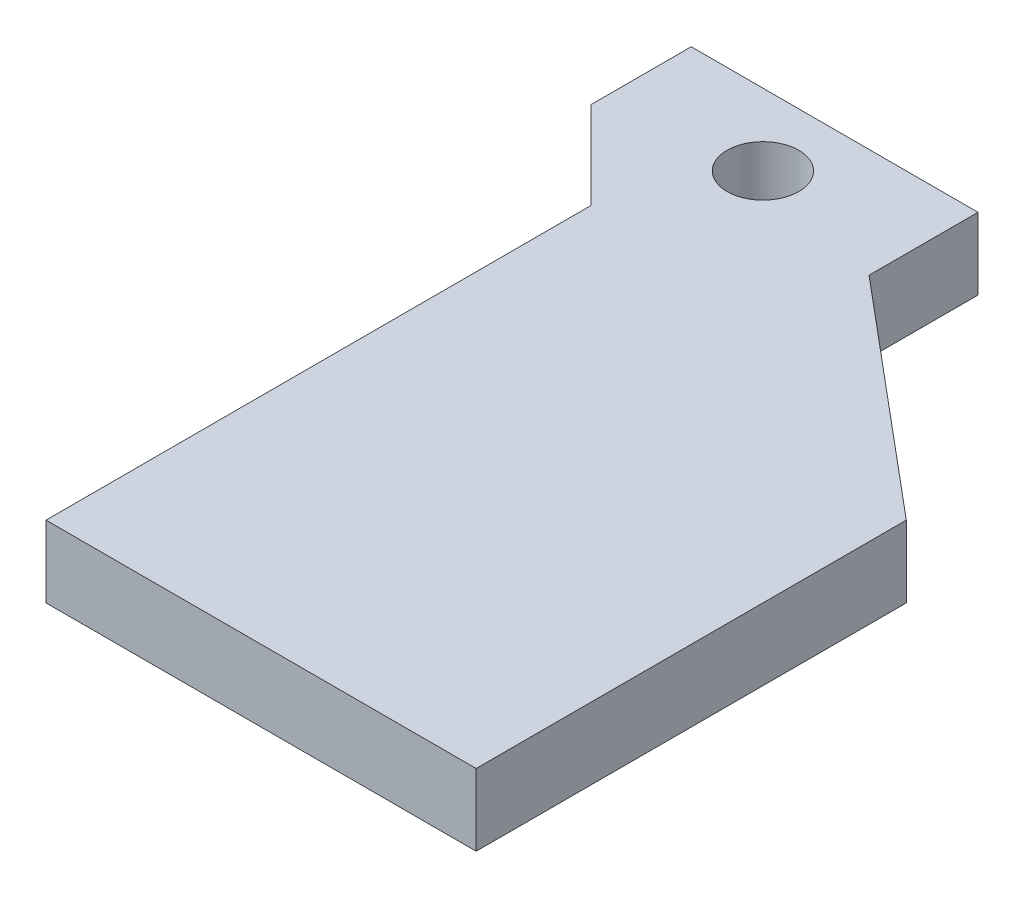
ISO-10303-21;
HEADER;
FILE_DESCRIPTION(('STEP AP214'),'2;1');
FILE_NAME('part.step','',(''),(''),'','','');
FILE_SCHEMA(('AUTOMOTIVE_DESIGN { 1 0 10303 214 1 1 1 1 }'));
ENDSEC;
DATA;
#1=APPLICATION_CONTEXT('core data for automotive mechanical design processes');
#2=APPLICATION_PROTOCOL_DEFINITION('international standard','automotive_design',2000,#1);
#3=PRODUCT_CONTEXT('',#1,'mechanical');
#4=PRODUCT('Part','Part','',(#3));
#5=PRODUCT_RELATED_PRODUCT_CATEGORY('part','',(#4));
#6=PRODUCT_DEFINITION_FORMATION('','',#4);
#7=PRODUCT_DEFINITION_CONTEXT('part definition',#1,'design');
#8=PRODUCT_DEFINITION('design','',#6,#7);
#9=PRODUCT_DEFINITION_SHAPE('','',#8);
#10=(LENGTH_UNIT() NAMED_UNIT(*) SI_UNIT(.MILLI.,.METRE.));
#11=(NAMED_UNIT(*) PLANE_ANGLE_UNIT() SI_UNIT($,.RADIAN.));
#12=(NAMED_UNIT(*) SI_UNIT($,.STERADIAN.) SOLID_ANGLE_UNIT());
#13=UNCERTAINTY_MEASURE_WITH_UNIT(LENGTH_MEASURE(1.E-05),#10,'distance_accuracy_value','');
#14=(GEOMETRIC_REPRESENTATION_CONTEXT(3) GLOBAL_UNCERTAINTY_ASSIGNED_CONTEXT((#13)) GLOBAL_UNIT_ASSIGNED_CONTEXT((#10,
#11,#12)) REPRESENTATION_CONTEXT('',''));
#15=CARTESIAN_POINT('',(0.,0.,0.));
#16=DIRECTION('',(0.,0.,1.));
#17=DIRECTION('',(1.,0.,0.));
#18=AXIS2_PLACEMENT_3D('',#15,#16,#17);
#19=CARTESIAN_POINT('',(-5.35521441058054,5.,5.87849918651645));
#20=DIRECTION('',(1.,0.,0.));
#21=DIRECTION('',(0.,0.,-1.));
#22=AXIS2_PLACEMENT_3D('',#19,#20,#21);
#23=PLANE('',#22);
#24=DIRECTION('',(0.,0.,1.));
#25=VECTOR('',#24,1.);
#26=CARTESIAN_POINT('',(-5.35521441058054,0.,5.87849918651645));
#27=LINE('',#26,#25);
#28=CARTESIAN_POINT('',(-5.35521441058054,0.,-32.1215008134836));
#29=VERTEX_POINT('',#28);
#30=CARTESIAN_POINT('',(-5.35521441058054,0.,5.87849918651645));
#31=VERTEX_POINT('',#30);
#32=EDGE_CURVE('E94',#29,#31,#27,.T.);
#33=ORIENTED_EDGE('',*,*,#32,.T.);
#34=DIRECTION('',(0.,-1.,0.));
#35=VECTOR('',#34,1.);
#36=CARTESIAN_POINT('',(-5.35521441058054,5.,5.87849918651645));
#37=LINE('',#36,#35);
#38=CARTESIAN_POINT('',(-5.35521441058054,5.,5.87849918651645));
#39=VERTEX_POINT('',#38);
#40=EDGE_CURVE('E11',#39,#31,#37,.T.);
#41=ORIENTED_EDGE('',*,*,#40,.F.);
#42=DIRECTION('',(0.,0.,1.));
#43=VECTOR('',#42,1.);
#44=CARTESIAN_POINT('',(-5.35521441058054,5.,5.87849918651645));
#45=LINE('',#44,#43);
#46=CARTESIAN_POINT('',(-5.35521441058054,5.,-32.1215008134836));
#47=VERTEX_POINT('',#46);
#48=EDGE_CURVE('E126',#47,#39,#45,.T.);
#49=ORIENTED_EDGE('',*,*,#48,.F.);
#50=DIRECTION('',(0.,-1.,0.));
#51=VECTOR('',#50,1.);
#52=CARTESIAN_POINT('',(-5.35521441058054,5.,-32.1215008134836));
#53=LINE('',#52,#51);
#54=EDGE_CURVE('E107',#47,#29,#53,.T.);
#55=ORIENTED_EDGE('',*,*,#54,.T.);
#56=EDGE_LOOP('',(#33,#41,#49,#55));
#57=FACE_BOUND('',#56,.T.);
#58=ADVANCED_FACE('F26',(#57),#23,.F.);
#59=CARTESIAN_POINT('',(-5.35521441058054,5.,5.87849918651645));
#60=DIRECTION('',(0.,0.,-1.));
#61=DIRECTION('',(-1.,0.,0.));
#62=AXIS2_PLACEMENT_3D('',#59,#60,#61);
#63=PLANE('',#62);
#64=DIRECTION('',(1.,0.,0.));
#65=VECTOR('',#64,1.);
#66=CARTESIAN_POINT('',(-5.35521441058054,0.,5.87849918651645));
#67=LINE('',#66,#65);
#68=CARTESIAN_POINT('',(24.6447855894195,0.,5.87849918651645));
#69=VERTEX_POINT('',#68);
#70=EDGE_CURVE('E90',#31,#69,#67,.T.);
#71=ORIENTED_EDGE('',*,*,#70,.T.);
#72=DIRECTION('',(0.,-1.,0.));
#73=VECTOR('',#72,1.);
#74=CARTESIAN_POINT('',(24.6447855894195,5.,5.87849918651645));
#75=LINE('',#74,#73);
#76=CARTESIAN_POINT('',(24.6447855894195,5.,5.87849918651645));
#77=VERTEX_POINT('',#76);
#78=EDGE_CURVE('E33',#77,#69,#75,.T.);
#79=ORIENTED_EDGE('',*,*,#78,.F.);
#80=DIRECTION('',(1.,0.,0.));
#81=VECTOR('',#80,1.);
#82=CARTESIAN_POINT('',(-5.35521441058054,5.,5.87849918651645));
#83=LINE('',#82,#81);
#84=EDGE_CURVE('E103',#39,#77,#83,.T.);
#85=ORIENTED_EDGE('',*,*,#84,.F.);
#86=ORIENTED_EDGE('',*,*,#40,.T.);
#87=EDGE_LOOP('',(#71,#79,#85,#86));
#88=FACE_BOUND('',#87,.T.);
#89=ADVANCED_FACE('F102',(#88),#63,.F.);
#90=CARTESIAN_POINT('',(24.6447855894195,5.,5.87849918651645));
#91=DIRECTION('',(-1.,0.,0.));
#92=DIRECTION('',(0.,0.,1.));
#93=AXIS2_PLACEMENT_3D('',#90,#91,#92);
#94=PLANE('',#93);
#95=DIRECTION('',(0.,0.,-1.));
#96=VECTOR('',#95,1.);
#97=CARTESIAN_POINT('',(24.6447855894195,0.,5.87849918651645));
#98=LINE('',#97,#96);
#99=CARTESIAN_POINT('',(24.6447855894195,0.,-24.1215008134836));
#100=VERTEX_POINT('',#99);
#101=EDGE_CURVE('E96',#69,#100,#98,.T.);
#102=ORIENTED_EDGE('',*,*,#101,.T.);
#103=DIRECTION('',(0.,-1.,0.));
#104=VECTOR('',#103,1.);
#105=CARTESIAN_POINT('',(24.6447855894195,5.,-24.1215008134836));
#106=LINE('',#105,#104);
#107=CARTESIAN_POINT('',(24.6447855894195,5.,-24.1215008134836));
#108=VERTEX_POINT('',#107);
#109=EDGE_CURVE('E152',#108,#100,#106,.T.);
#110=ORIENTED_EDGE('',*,*,#109,.F.);
#111=DIRECTION('',(0.,0.,-1.));
#112=VECTOR('',#111,1.);
#113=CARTESIAN_POINT('',(24.6447855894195,5.,5.87849918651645));
#114=LINE('',#113,#112);
#115=EDGE_CURVE('E129',#77,#108,#114,.T.);
#116=ORIENTED_EDGE('',*,*,#115,.F.);
#117=ORIENTED_EDGE('',*,*,#78,.T.);
#118=EDGE_LOOP('',(#102,#110,#116,#117));
#119=FACE_BOUND('',#118,.T.);
#120=ADVANCED_FACE('F156',(#119),#94,.F.);
#121=CARTESIAN_POINT('',(24.6447855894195,5.,-24.1215008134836));
#122=DIRECTION('',(-0.642487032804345,0.,0.766296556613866));
#123=DIRECTION('',(0.766296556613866,0.,0.642487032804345));
#124=AXIS2_PLACEMENT_3D('',#121,#122,#123);
#125=PLANE('',#124);
#126=DIRECTION('',(-0.766296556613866,0.,-0.642487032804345));
#127=VECTOR('',#126,1.);
#128=CARTESIAN_POINT('',(24.6447855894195,0.,-24.1215008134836));
#129=LINE('',#128,#127);
#130=CARTESIAN_POINT('',(8.55255790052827,0.,-37.6137285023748));
#131=VERTEX_POINT('',#130);
#132=EDGE_CURVE('E116',#100,#131,#129,.T.);
#133=ORIENTED_EDGE('',*,*,#132,.T.);
#134=DIRECTION('',(0.,-1.,0.));
#135=VECTOR('',#134,1.);
#136=CARTESIAN_POINT('',(8.55255790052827,5.,-37.6137285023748));
#137=LINE('',#136,#135);
#138=CARTESIAN_POINT('',(8.55255790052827,5.,-37.6137285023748));
#139=VERTEX_POINT('',#138);
#140=EDGE_CURVE('E149',#139,#131,#137,.T.);
#141=ORIENTED_EDGE('',*,*,#140,.F.);
#142=DIRECTION('',(-0.766296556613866,0.,-0.642487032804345));
#143=VECTOR('',#142,1.);
#144=CARTESIAN_POINT('',(24.6447855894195,5.,-24.1215008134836));
#145=LINE('',#144,#143);
#146=EDGE_CURVE('E131',#108,#139,#145,.T.);
#147=ORIENTED_EDGE('',*,*,#146,.F.);
#148=ORIENTED_EDGE('',*,*,#109,.T.);
#149=EDGE_LOOP('',(#133,#141,#147,#148));
#150=FACE_BOUND('',#149,.T.);
#151=ADVANCED_FACE('F164',(#150),#125,.F.);
#152=CARTESIAN_POINT('',(8.55255790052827,5.,-37.6137285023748));
#153=DIRECTION('',(-1.,0.,0.));
#154=DIRECTION('',(0.,0.,1.));
#155=AXIS2_PLACEMENT_3D('',#152,#153,#154);
#156=PLANE('',#155);
#157=DIRECTION('',(0.,0.,-1.));
#158=VECTOR('',#157,1.);
#159=CARTESIAN_POINT('',(8.55255790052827,0.,-37.6137285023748));
#160=LINE('',#159,#158);
#161=CARTESIAN_POINT('',(8.55255790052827,0.,-45.2137285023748));
#162=VERTEX_POINT('',#161);
#163=EDGE_CURVE('E118',#131,#162,#160,.T.);
#164=ORIENTED_EDGE('',*,*,#163,.T.);
#165=DIRECTION('',(0.,-1.,0.));
#166=VECTOR('',#165,1.);
#167=CARTESIAN_POINT('',(8.55255790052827,5.,-45.2137285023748));
#168=LINE('',#167,#166);
#169=CARTESIAN_POINT('',(8.55255790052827,5.,-45.2137285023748));
#170=VERTEX_POINT('',#169);
#171=EDGE_CURVE('E146',#170,#162,#168,.T.);
#172=ORIENTED_EDGE('',*,*,#171,.F.);
#173=DIRECTION('',(0.,0.,-1.));
#174=VECTOR('',#173,1.);
#175=CARTESIAN_POINT('',(8.55255790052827,5.,-37.6137285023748));
#176=LINE('',#175,#174);
#177=EDGE_CURVE('E133',#139,#170,#176,.T.);
#178=ORIENTED_EDGE('',*,*,#177,.F.);
#179=ORIENTED_EDGE('',*,*,#140,.T.);
#180=EDGE_LOOP('',(#164,#172,#178,#179));
#181=FACE_BOUND('',#180,.T.);
#182=ADVANCED_FACE('F167',(#181),#156,.F.);
#183=CARTESIAN_POINT('',(8.55255790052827,5.,-45.2137285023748));
#184=DIRECTION('',(0.,0.,1.));
#185=DIRECTION('',(1.,0.,0.));
#186=AXIS2_PLACEMENT_3D('',#183,#184,#185);
#187=PLANE('',#186);
#188=DIRECTION('',(-1.,0.,0.));
#189=VECTOR('',#188,1.);
#190=CARTESIAN_POINT('',(8.55255790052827,0.,-45.2137285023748));
#191=LINE('',#190,#189);
#192=CARTESIAN_POINT('',(-11.4474420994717,0.,-45.2137285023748));
#193=VERTEX_POINT('',#192);
#194=EDGE_CURVE('E120',#162,#193,#191,.T.);
#195=ORIENTED_EDGE('',*,*,#194,.T.);
#196=DIRECTION('',(0.,-1.,0.));
#197=VECTOR('',#196,1.);
#198=CARTESIAN_POINT('',(-11.4474420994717,5.,-45.2137285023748));
#199=LINE('',#198,#197);
#200=CARTESIAN_POINT('',(-11.4474420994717,5.,-45.2137285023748));
#201=VERTEX_POINT('',#200);
#202=EDGE_CURVE('E143',#201,#193,#199,.T.);
#203=ORIENTED_EDGE('',*,*,#202,.F.);
#204=DIRECTION('',(-1.,0.,0.));
#205=VECTOR('',#204,1.);
#206=CARTESIAN_POINT('',(8.55255790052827,5.,-45.2137285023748));
#207=LINE('',#206,#205);
#208=EDGE_CURVE('E135',#170,#201,#207,.T.);
#209=ORIENTED_EDGE('',*,*,#208,.F.);
#210=ORIENTED_EDGE('',*,*,#171,.T.);
#211=EDGE_LOOP('',(#195,#203,#209,#210));
#212=FACE_BOUND('',#211,.T.);
#213=ADVANCED_FACE('F172',(#212),#187,.F.);
#214=CARTESIAN_POINT('',(-11.4474420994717,5.,-45.2137285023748));
#215=DIRECTION('',(1.,0.,0.));
#216=DIRECTION('',(0.,0.,-1.));
#217=AXIS2_PLACEMENT_3D('',#214,#215,#216);
#218=PLANE('',#217);
#219=DIRECTION('',(0.,0.,1.));
#220=VECTOR('',#219,1.);
#221=CARTESIAN_POINT('',(-11.4474420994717,0.,-45.2137285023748));
#222=LINE('',#221,#220);
#223=CARTESIAN_POINT('',(-11.4474420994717,0.,-38.2137285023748));
#224=VERTEX_POINT('',#223);
#225=EDGE_CURVE('E122',#193,#224,#222,.T.);
#226=ORIENTED_EDGE('',*,*,#225,.T.);
#227=DIRECTION('',(0.,-1.,0.));
#228=VECTOR('',#227,1.);
#229=CARTESIAN_POINT('',(-11.4474420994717,5.,-38.2137285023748));
#230=LINE('',#229,#228);
#231=CARTESIAN_POINT('',(-11.4474420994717,5.,-38.2137285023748));
#232=VERTEX_POINT('',#231);
#233=EDGE_CURVE('E140',#232,#224,#230,.T.);
#234=ORIENTED_EDGE('',*,*,#233,.F.);
#235=DIRECTION('',(0.,0.,1.));
#236=VECTOR('',#235,1.);
#237=CARTESIAN_POINT('',(-11.4474420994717,5.,-45.2137285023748));
#238=LINE('',#237,#236);
#239=EDGE_CURVE('E45',#201,#232,#238,.T.);
#240=ORIENTED_EDGE('',*,*,#239,.F.);
#241=ORIENTED_EDGE('',*,*,#202,.T.);
#242=EDGE_LOOP('',(#226,#234,#240,#241));
#243=FACE_BOUND('',#242,.T.);
#244=ADVANCED_FACE('F175',(#243),#218,.F.);
#245=CARTESIAN_POINT('',(-11.4474420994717,5.,-38.2137285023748));
#246=DIRECTION('',(0.707106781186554,0.,-0.707106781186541));
#247=DIRECTION('',(-0.707106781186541,0.,-0.707106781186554));
#248=AXIS2_PLACEMENT_3D('',#245,#246,#247);
#249=PLANE('',#248);
#250=DIRECTION('',(0.707106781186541,0.,0.707106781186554));
#251=VECTOR('',#250,1.);
#252=CARTESIAN_POINT('',(-11.4474420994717,0.,-38.2137285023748));
#253=LINE('',#252,#251);
#254=EDGE_CURVE('E124',#224,#29,#253,.T.);
#255=ORIENTED_EDGE('',*,*,#254,.T.);
#256=ORIENTED_EDGE('',*,*,#54,.F.);
#257=DIRECTION('',(0.707106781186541,0.,0.707106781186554));
#258=VECTOR('',#257,1.);
#259=CARTESIAN_POINT('',(-11.4474420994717,5.,-38.2137285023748));
#260=LINE('',#259,#258);
#261=EDGE_CURVE('E40',#232,#47,#260,.T.);
#262=ORIENTED_EDGE('',*,*,#261,.F.);
#263=ORIENTED_EDGE('',*,*,#233,.T.);
#264=EDGE_LOOP('',(#255,#256,#262,#263));
#265=FACE_BOUND('',#264,.T.);
#266=ADVANCED_FACE('F177',(#265),#249,.F.);
#267=CARTESIAN_POINT('',(-5.35521441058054,5.,5.87849918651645));
#268=DIRECTION('',(0.,-1.,0.));
#269=DIRECTION('',(0.,0.,-1.));
#270=AXIS2_PLACEMENT_3D('',#267,#268,#269);
#271=PLANE('',#270);
#272=CARTESIAN_POINT('',(-1.44744209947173,5.,-40.2137285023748));
#273=DIRECTION('',(0.,1.,0.));
#274=DIRECTION('',(0.,0.,1.));
#275=AXIS2_PLACEMENT_3D('',#272,#273,#274);
#276=CIRCLE('',#275,2.5);
#277=CARTESIAN_POINT('',(-1.44744209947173,5.,-37.7137285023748));
#278=VERTEX_POINT('',#277);
#279=EDGE_CURVE('E111',#278,#278,#276,.T.);
#280=ORIENTED_EDGE('',*,*,#279,.F.);
#281=EDGE_LOOP('',(#280));
#282=FACE_BOUND('',#281,.T.);
#283=ORIENTED_EDGE('',*,*,#48,.T.);
#284=ORIENTED_EDGE('',*,*,#84,.T.);
#285=ORIENTED_EDGE('',*,*,#115,.T.);
#286=ORIENTED_EDGE('',*,*,#146,.T.);
#287=ORIENTED_EDGE('',*,*,#177,.T.);
#288=ORIENTED_EDGE('',*,*,#208,.T.);
#289=ORIENTED_EDGE('',*,*,#239,.T.);
#290=ORIENTED_EDGE('',*,*,#261,.T.);
#291=EDGE_LOOP('',(#283,#284,#285,#286,#287,#288,#289,#290));
#292=FACE_BOUND('',#291,.T.);
#293=ADVANCED_FACE('F159',(#282,#292),#271,.F.);
#294=CARTESIAN_POINT('',(-5.35521441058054,0.,5.87849918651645));
#295=DIRECTION('',(0.,-1.,0.));
#296=DIRECTION('',(0.,0.,-1.));
#297=AXIS2_PLACEMENT_3D('',#294,#295,#296);
#298=PLANE('',#297);
#299=CARTESIAN_POINT('',(-1.44744209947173,0.,-40.2137285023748));
#300=DIRECTION('',(0.,1.,0.));
#301=DIRECTION('',(0.,0.,1.));
#302=AXIS2_PLACEMENT_3D('',#299,#300,#301);
#303=CIRCLE('',#302,2.5);
#304=CARTESIAN_POINT('',(-1.44744209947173,0.,-37.7137285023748));
#305=VERTEX_POINT('',#304);
#306=EDGE_CURVE('E108',#305,#305,#303,.T.);
#307=ORIENTED_EDGE('',*,*,#306,.T.);
#308=EDGE_LOOP('',(#307));
#309=FACE_BOUND('',#308,.T.);
#310=ORIENTED_EDGE('',*,*,#32,.F.);
#311=ORIENTED_EDGE('',*,*,#254,.F.);
#312=ORIENTED_EDGE('',*,*,#225,.F.);
#313=ORIENTED_EDGE('',*,*,#194,.F.);
#314=ORIENTED_EDGE('',*,*,#163,.F.);
#315=ORIENTED_EDGE('',*,*,#132,.F.);
#316=ORIENTED_EDGE('',*,*,#101,.F.);
#317=ORIENTED_EDGE('',*,*,#70,.F.);
#318=EDGE_LOOP('',(#310,#311,#312,#313,#314,#315,#316,#317));
#319=FACE_BOUND('',#318,.T.);
#320=ADVANCED_FACE('F91',(#309,#319),#298,.T.);
#321=CARTESIAN_POINT('',(-1.44744209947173,0.,-40.2137285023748));
#322=DIRECTION('',(0.,1.,0.));
#323=DIRECTION('',(0.,0.,1.));
#324=AXIS2_PLACEMENT_3D('',#321,#322,#323);
#325=CYLINDRICAL_SURFACE('',#324,2.5);
#326=ORIENTED_EDGE('',*,*,#306,.F.);
#327=EDGE_LOOP('',(#326));
#328=FACE_BOUND('',#327,.T.);
#329=ORIENTED_EDGE('',*,*,#279,.T.);
#330=EDGE_LOOP('',(#329));
#331=FACE_BOUND('',#330,.T.);
#332=ADVANCED_FACE('F222',(#328,#331),#325,.F.);
#333=CLOSED_SHELL('',(#58,#89,#120,#151,#182,#213,#244,#266,#293,#320,#332));
#334=MANIFOLD_SOLID_BREP('B2',#333);
#335=ADVANCED_BREP_SHAPE_REPRESENTATION('',(#18,#334),#14);
#336=SHAPE_DEFINITION_REPRESENTATION(#9,#335);
ENDSEC;
END-ISO-10303-21;
